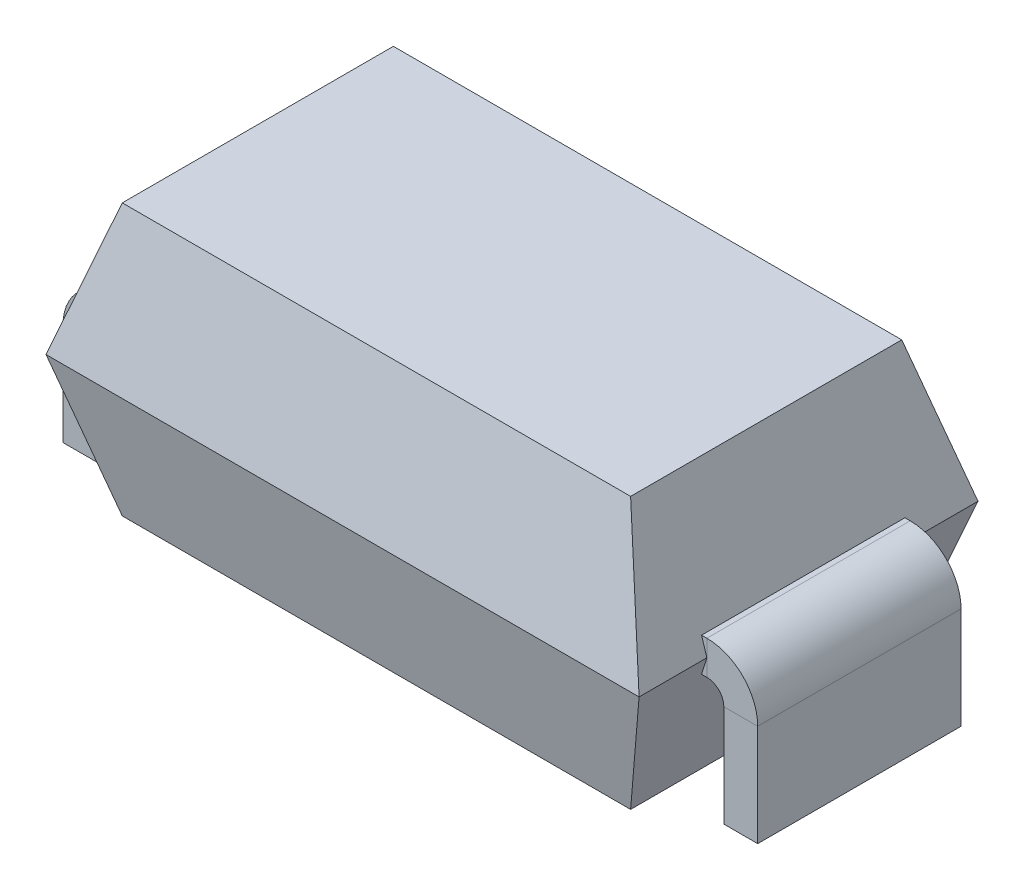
ISO-10303-21;
HEADER;
FILE_DESCRIPTION(('STEP AP214'),'2;1');
FILE_NAME('part.step','',(''),(''),'','','');
FILE_SCHEMA(('AUTOMOTIVE_DESIGN { 1 0 10303 214 1 1 1 1 }'));
ENDSEC;
DATA;
#1=APPLICATION_CONTEXT('core data for automotive mechanical design processes');
#2=APPLICATION_PROTOCOL_DEFINITION('international standard','automotive_design',2000,#1);
#3=PRODUCT_CONTEXT('',#1,'mechanical');
#4=PRODUCT('Part','Part','',(#3));
#5=PRODUCT_RELATED_PRODUCT_CATEGORY('part','',(#4));
#6=PRODUCT_DEFINITION_FORMATION('','',#4);
#7=PRODUCT_DEFINITION_CONTEXT('part definition',#1,'design');
#8=PRODUCT_DEFINITION('design','',#6,#7);
#9=PRODUCT_DEFINITION_SHAPE('','',#8);
#10=(LENGTH_UNIT() NAMED_UNIT(*) SI_UNIT(.MILLI.,.METRE.));
#11=(NAMED_UNIT(*) PLANE_ANGLE_UNIT() SI_UNIT($,.RADIAN.));
#12=(NAMED_UNIT(*) SI_UNIT($,.STERADIAN.) SOLID_ANGLE_UNIT());
#13=UNCERTAINTY_MEASURE_WITH_UNIT(LENGTH_MEASURE(1.E-05),#10,'distance_accuracy_value','');
#14=(GEOMETRIC_REPRESENTATION_CONTEXT(3) GLOBAL_UNCERTAINTY_ASSIGNED_CONTEXT((#13)) GLOBAL_UNIT_ASSIGNED_CONTEXT((#10,
#11,#12)) REPRESENTATION_CONTEXT('',''));
#15=CARTESIAN_POINT('',(0.,0.,0.));
#16=DIRECTION('',(0.,0.,1.));
#17=DIRECTION('',(1.,0.,0.));
#18=AXIS2_PLACEMENT_3D('',#15,#16,#17);
#19=CARTESIAN_POINT('',(0.,0.8,0.));
#20=DIRECTION('',(0.,1.,0.));
#21=DIRECTION('',(0.,0.,1.));
#22=AXIS2_PLACEMENT_3D('',#19,#20,#21);
#23=PLANE('',#22);
#24=DIRECTION('',(0.,0.,-1.));
#25=VECTOR('',#24,1.);
#26=CARTESIAN_POINT('',(1.5,0.8,-0.8));
#27=LINE('',#26,#25);
#28=CARTESIAN_POINT('',(1.5,0.8,0.8));
#29=VERTEX_POINT('',#28);
#30=CARTESIAN_POINT('',(1.5,0.8,-0.8));
#31=VERTEX_POINT('',#30);
#32=EDGE_CURVE('E568',#29,#31,#27,.T.);
#33=ORIENTED_EDGE('',*,*,#32,.T.);
#34=DIRECTION('',(-1.,0.,0.));
#35=VECTOR('',#34,1.);
#36=CARTESIAN_POINT('',(-1.5,0.8,-0.8));
#37=LINE('',#36,#35);
#38=CARTESIAN_POINT('',(-1.5,0.8,-0.8));
#39=VERTEX_POINT('',#38);
#40=EDGE_CURVE('E465',#31,#39,#37,.T.);
#41=ORIENTED_EDGE('',*,*,#40,.T.);
#42=DIRECTION('',(0.,0.,1.));
#43=VECTOR('',#42,1.);
#44=CARTESIAN_POINT('',(-1.5,0.8,-0.8));
#45=LINE('',#44,#43);
#46=CARTESIAN_POINT('',(-1.5,0.8,0.8));
#47=VERTEX_POINT('',#46);
#48=EDGE_CURVE('E688',#39,#47,#45,.T.);
#49=ORIENTED_EDGE('',*,*,#48,.T.);
#50=DIRECTION('',(1.,0.,0.));
#51=VECTOR('',#50,1.);
#52=CARTESIAN_POINT('',(-1.5,0.8,0.8));
#53=LINE('',#52,#51);
#54=EDGE_CURVE('E681',#47,#29,#53,.T.);
#55=ORIENTED_EDGE('',*,*,#54,.T.);
#56=EDGE_LOOP('',(#33,#41,#49,#55));
#57=FACE_BOUND('',#56,.T.);
#58=ADVANCED_FACE('F53',(#57),#23,.T.);
#59=CARTESIAN_POINT('',(-1.59430604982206,0.498220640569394,0.));
#60=DIRECTION('',(0.95447997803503,-0.298274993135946,0.));
#61=DIRECTION('',(0.298274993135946,0.95447997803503,0.));
#62=AXIS2_PLACEMENT_3D('',#59,#60,#61);
#63=PLANE('',#62);
#64=DIRECTION('',(0.,0.,1.));
#65=VECTOR('',#64,1.);
#66=CARTESIAN_POINT('',(-1.75,0.,-1.));
#67=LINE('',#66,#65);
#68=CARTESIAN_POINT('',(-1.75,0.,-1.));
#69=VERTEX_POINT('',#68);
#70=CARTESIAN_POINT('',(-1.75,0.,-0.6));
#71=VERTEX_POINT('',#70);
#72=EDGE_CURVE('E57',#69,#71,#67,.T.);
#73=ORIENTED_EDGE('',*,*,#72,.T.);
#74=DIRECTION('',(0.298274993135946,0.95447997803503,0.));
#75=VECTOR('',#74,1.);
#76=CARTESIAN_POINT('',(-1.59430604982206,0.498220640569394,-0.6));
#77=LINE('',#76,#75);
#78=CARTESIAN_POINT('',(-1.71875,0.1,-0.6));
#79=VERTEX_POINT('',#78);
#80=EDGE_CURVE('E250',#71,#79,#77,.T.);
#81=ORIENTED_EDGE('',*,*,#80,.T.);
#82=DIRECTION('',(0.,0.,1.));
#83=VECTOR('',#82,1.);
#84=CARTESIAN_POINT('',(-1.71875,0.1,0.));
#85=LINE('',#84,#83);
#86=CARTESIAN_POINT('',(-1.71875,0.1,0.6));
#87=VERTEX_POINT('',#86);
#88=EDGE_CURVE('E12',#79,#87,#85,.T.);
#89=ORIENTED_EDGE('',*,*,#88,.T.);
#90=DIRECTION('',(-0.298274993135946,-0.95447997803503,0.));
#91=VECTOR('',#90,1.);
#92=CARTESIAN_POINT('',(-1.59430604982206,0.498220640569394,0.6));
#93=LINE('',#92,#91);
#94=CARTESIAN_POINT('',(-1.75,0.,0.6));
#95=VERTEX_POINT('',#94);
#96=EDGE_CURVE('E260',#87,#95,#93,.T.);
#97=ORIENTED_EDGE('',*,*,#96,.T.);
#98=CARTESIAN_POINT('',(-1.75,0.,1.));
#99=VERTEX_POINT('',#98);
#100=EDGE_CURVE('E496',#95,#99,#67,.T.);
#101=ORIENTED_EDGE('',*,*,#100,.T.);
#102=DIRECTION('',(0.290129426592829,0.928414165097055,-0.232103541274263));
#103=VECTOR('',#102,1.);
#104=CARTESIAN_POINT('',(-1.75,0.,1.));
#105=LINE('',#104,#103);
#106=EDGE_CURVE('E498',#99,#47,#105,.T.);
#107=ORIENTED_EDGE('',*,*,#106,.T.);
#108=ORIENTED_EDGE('',*,*,#48,.F.);
#109=DIRECTION('',(0.29012942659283,0.928414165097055,0.232103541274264));
#110=VECTOR('',#109,1.);
#111=CARTESIAN_POINT('',(-1.75,0.,-1.));
#112=LINE('',#111,#110);
#113=EDGE_CURVE('E572',#69,#39,#112,.T.);
#114=ORIENTED_EDGE('',*,*,#113,.F.);
#115=EDGE_LOOP('',(#73,#81,#89,#97,#101,#107,#108,#114));
#116=FACE_BOUND('',#115,.T.);
#117=ADVANCED_FACE('F314',(#116),#63,.F.);
#118=CARTESIAN_POINT('',(0.,0.235294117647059,-0.941176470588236));
#119=DIRECTION('',(0.,-0.242535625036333,0.970142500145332));
#120=DIRECTION('',(0.,-0.970142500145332,-0.242535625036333));
#121=AXIS2_PLACEMENT_3D('',#118,#119,#120);
#122=PLANE('',#121);
#123=ORIENTED_EDGE('',*,*,#113,.T.);
#124=ORIENTED_EDGE('',*,*,#40,.F.);
#125=DIRECTION('',(-0.290129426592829,0.928414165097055,0.232103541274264));
#126=VECTOR('',#125,1.);
#127=CARTESIAN_POINT('',(1.75,0.,-1.));
#128=LINE('',#127,#126);
#129=CARTESIAN_POINT('',(1.75,0.,-1.));
#130=VERTEX_POINT('',#129);
#131=EDGE_CURVE('E561',#130,#31,#128,.T.);
#132=ORIENTED_EDGE('',*,*,#131,.F.);
#133=DIRECTION('',(-1.,0.,0.));
#134=VECTOR('',#133,1.);
#135=CARTESIAN_POINT('',(-1.75,0.,-1.));
#136=LINE('',#135,#134);
#137=EDGE_CURVE('E354',#130,#69,#136,.T.);
#138=ORIENTED_EDGE('',*,*,#137,.T.);
#139=EDGE_LOOP('',(#123,#124,#132,#138));
#140=FACE_BOUND('',#139,.T.);
#141=ADVANCED_FACE('F545',(#140),#122,.F.);
#142=CARTESIAN_POINT('',(0.,0.235294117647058,0.941176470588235));
#143=DIRECTION('',(0.,-0.242535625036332,-0.970142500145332));
#144=DIRECTION('',(0.,0.970142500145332,-0.242535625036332));
#145=AXIS2_PLACEMENT_3D('',#142,#143,#144);
#146=PLANE('',#145);
#147=DIRECTION('',(-0.29012942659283,0.928414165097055,-0.232103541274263));
#148=VECTOR('',#147,1.);
#149=CARTESIAN_POINT('',(1.75,0.,1.));
#150=LINE('',#149,#148);
#151=CARTESIAN_POINT('',(1.75,0.,1.));
#152=VERTEX_POINT('',#151);
#153=EDGE_CURVE('E569',#152,#29,#150,.T.);
#154=ORIENTED_EDGE('',*,*,#153,.T.);
#155=ORIENTED_EDGE('',*,*,#54,.F.);
#156=ORIENTED_EDGE('',*,*,#106,.F.);
#157=DIRECTION('',(1.,0.,0.));
#158=VECTOR('',#157,1.);
#159=CARTESIAN_POINT('',(-1.75,0.,1.));
#160=LINE('',#159,#158);
#161=EDGE_CURVE('E493',#99,#152,#160,.T.);
#162=ORIENTED_EDGE('',*,*,#161,.T.);
#163=EDGE_LOOP('',(#154,#155,#156,#162));
#164=FACE_BOUND('',#163,.T.);
#165=ADVANCED_FACE('F518',(#164),#146,.F.);
#166=CARTESIAN_POINT('',(1.59430604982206,0.498220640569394,0.));
#167=DIRECTION('',(-0.95447997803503,-0.298274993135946,0.));
#168=DIRECTION('',(0.298274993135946,-0.95447997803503,0.));
#169=AXIS2_PLACEMENT_3D('',#166,#167,#168);
#170=PLANE('',#169);
#171=DIRECTION('',(0.,0.,-1.));
#172=VECTOR('',#171,1.);
#173=CARTESIAN_POINT('',(1.75,0.,-1.));
#174=LINE('',#173,#172);
#175=CARTESIAN_POINT('',(1.75,0.,0.6));
#176=VERTEX_POINT('',#175);
#177=EDGE_CURVE('E481',#152,#176,#174,.T.);
#178=ORIENTED_EDGE('',*,*,#177,.T.);
#179=DIRECTION('',(-0.298274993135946,0.95447997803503,0.));
#180=VECTOR('',#179,1.);
#181=CARTESIAN_POINT('',(1.59430604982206,0.498220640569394,0.6));
#182=LINE('',#181,#180);
#183=CARTESIAN_POINT('',(1.71875,0.1,0.6));
#184=VERTEX_POINT('',#183);
#185=EDGE_CURVE('E340',#176,#184,#182,.T.);
#186=ORIENTED_EDGE('',*,*,#185,.T.);
#187=DIRECTION('',(0.,0.,-1.));
#188=VECTOR('',#187,1.);
#189=CARTESIAN_POINT('',(1.71875,0.1,0.));
#190=LINE('',#189,#188);
#191=CARTESIAN_POINT('',(1.71875,0.1,-0.6));
#192=VERTEX_POINT('',#191);
#193=EDGE_CURVE('E473',#184,#192,#190,.T.);
#194=ORIENTED_EDGE('',*,*,#193,.T.);
#195=DIRECTION('',(0.298274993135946,-0.95447997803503,0.));
#196=VECTOR('',#195,1.);
#197=CARTESIAN_POINT('',(1.59430604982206,0.498220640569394,-0.6));
#198=LINE('',#197,#196);
#199=CARTESIAN_POINT('',(1.75,0.,-0.6));
#200=VERTEX_POINT('',#199);
#201=EDGE_CURVE('E337',#192,#200,#198,.T.);
#202=ORIENTED_EDGE('',*,*,#201,.T.);
#203=EDGE_CURVE('E459',#200,#130,#174,.T.);
#204=ORIENTED_EDGE('',*,*,#203,.T.);
#205=ORIENTED_EDGE('',*,*,#131,.T.);
#206=ORIENTED_EDGE('',*,*,#32,.F.);
#207=ORIENTED_EDGE('',*,*,#153,.F.);
#208=EDGE_LOOP('',(#178,#186,#194,#202,#204,#205,#206,#207));
#209=FACE_BOUND('',#208,.T.);
#210=ADVANCED_FACE('F509',(#209),#170,.F.);
#211=CARTESIAN_POINT('',(0.,-0.8,0.));
#212=DIRECTION('',(0.,-1.,0.));
#213=DIRECTION('',(0.,0.,1.));
#214=AXIS2_PLACEMENT_3D('',#211,#212,#213);
#215=PLANE('',#214);
#216=DIRECTION('',(0.,0.,-1.));
#217=VECTOR('',#216,1.);
#218=CARTESIAN_POINT('',(1.5,-0.8,-0.8));
#219=LINE('',#218,#217);
#220=CARTESIAN_POINT('',(1.5,-0.8,0.8));
#221=VERTEX_POINT('',#220);
#222=CARTESIAN_POINT('',(1.5,-0.8,-0.8));
#223=VERTEX_POINT('',#222);
#224=EDGE_CURVE('E423',#221,#223,#219,.T.);
#225=ORIENTED_EDGE('',*,*,#224,.F.);
#226=DIRECTION('',(1.,0.,0.));
#227=VECTOR('',#226,1.);
#228=CARTESIAN_POINT('',(-1.5,-0.8,0.8));
#229=LINE('',#228,#227);
#230=CARTESIAN_POINT('',(-1.5,-0.8,0.8));
#231=VERTEX_POINT('',#230);
#232=EDGE_CURVE('E409',#231,#221,#229,.T.);
#233=ORIENTED_EDGE('',*,*,#232,.F.);
#234=DIRECTION('',(0.,0.,1.));
#235=VECTOR('',#234,1.);
#236=CARTESIAN_POINT('',(-1.5,-0.8,-0.8));
#237=LINE('',#236,#235);
#238=CARTESIAN_POINT('',(-1.5,-0.8,-0.8));
#239=VERTEX_POINT('',#238);
#240=EDGE_CURVE('E396',#239,#231,#237,.T.);
#241=ORIENTED_EDGE('',*,*,#240,.F.);
#242=DIRECTION('',(-1.,0.,0.));
#243=VECTOR('',#242,1.);
#244=CARTESIAN_POINT('',(-1.5,-0.8,-0.8));
#245=LINE('',#244,#243);
#246=EDGE_CURVE('E482',#223,#239,#245,.T.);
#247=ORIENTED_EDGE('',*,*,#246,.F.);
#248=EDGE_LOOP('',(#225,#233,#241,#247));
#249=FACE_BOUND('',#248,.T.);
#250=ADVANCED_FACE('F439',(#249),#215,.T.);
#251=CARTESIAN_POINT('',(-1.59430604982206,-0.498220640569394,0.));
#252=DIRECTION('',(0.95447997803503,0.298274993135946,0.));
#253=DIRECTION('',(0.298274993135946,-0.95447997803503,0.));
#254=AXIS2_PLACEMENT_3D('',#251,#252,#253);
#255=PLANE('',#254);
#256=DIRECTION('',(0.,0.,-1.));
#257=VECTOR('',#256,1.);
#258=CARTESIAN_POINT('',(-1.71875,-0.1,0.));
#259=LINE('',#258,#257);
#260=CARTESIAN_POINT('',(-1.71875,-0.1,0.6));
#261=VERTEX_POINT('',#260);
#262=CARTESIAN_POINT('',(-1.71875,-0.0999999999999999,-0.6));
#263=VERTEX_POINT('',#262);
#264=EDGE_CURVE('E934',#261,#263,#259,.T.);
#265=ORIENTED_EDGE('',*,*,#264,.T.);
#266=DIRECTION('',(-0.298274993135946,0.95447997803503,0.));
#267=VECTOR('',#266,1.);
#268=CARTESIAN_POINT('',(-1.59430604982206,-0.498220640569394,-0.6));
#269=LINE('',#268,#267);
#270=EDGE_CURVE('E63',#263,#71,#269,.T.);
#271=ORIENTED_EDGE('',*,*,#270,.T.);
#272=ORIENTED_EDGE('',*,*,#72,.F.);
#273=DIRECTION('',(0.29012942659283,-0.928414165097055,0.232103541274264));
#274=VECTOR('',#273,1.);
#275=CARTESIAN_POINT('',(-1.75,0.,-1.));
#276=LINE('',#275,#274);
#277=EDGE_CURVE('E604',#69,#239,#276,.T.);
#278=ORIENTED_EDGE('',*,*,#277,.T.);
#279=ORIENTED_EDGE('',*,*,#240,.T.);
#280=DIRECTION('',(0.290129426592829,-0.928414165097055,-0.232103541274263));
#281=VECTOR('',#280,1.);
#282=CARTESIAN_POINT('',(-1.75,0.,1.));
#283=LINE('',#282,#281);
#284=EDGE_CURVE('E346',#99,#231,#283,.T.);
#285=ORIENTED_EDGE('',*,*,#284,.F.);
#286=ORIENTED_EDGE('',*,*,#100,.F.);
#287=DIRECTION('',(0.298274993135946,-0.95447997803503,0.));
#288=VECTOR('',#287,1.);
#289=CARTESIAN_POINT('',(-1.59430604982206,-0.498220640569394,0.6));
#290=LINE('',#289,#288);
#291=EDGE_CURVE('E478',#95,#261,#290,.T.);
#292=ORIENTED_EDGE('',*,*,#291,.T.);
#293=EDGE_LOOP('',(#265,#271,#272,#278,#279,#285,#286,#292));
#294=FACE_BOUND('',#293,.T.);
#295=ADVANCED_FACE('F373',(#294),#255,.F.);
#296=CARTESIAN_POINT('',(0.,-0.235294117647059,-0.941176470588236));
#297=DIRECTION('',(0.,0.242535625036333,0.970142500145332));
#298=DIRECTION('',(0.,0.970142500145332,-0.242535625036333));
#299=AXIS2_PLACEMENT_3D('',#296,#297,#298);
#300=PLANE('',#299);
#301=ORIENTED_EDGE('',*,*,#277,.F.);
#302=ORIENTED_EDGE('',*,*,#137,.F.);
#303=DIRECTION('',(-0.290129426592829,-0.928414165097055,0.232103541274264));
#304=VECTOR('',#303,1.);
#305=CARTESIAN_POINT('',(1.75,0.,-1.));
#306=LINE('',#305,#304);
#307=EDGE_CURVE('E360',#130,#223,#306,.T.);
#308=ORIENTED_EDGE('',*,*,#307,.T.);
#309=ORIENTED_EDGE('',*,*,#246,.T.);
#310=EDGE_LOOP('',(#301,#302,#308,#309));
#311=FACE_BOUND('',#310,.T.);
#312=ADVANCED_FACE('F362',(#311),#300,.F.);
#313=CARTESIAN_POINT('',(0.,-0.235294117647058,0.941176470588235));
#314=DIRECTION('',(0.,0.242535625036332,-0.970142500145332));
#315=DIRECTION('',(0.,-0.970142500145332,-0.242535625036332));
#316=AXIS2_PLACEMENT_3D('',#313,#314,#315);
#317=PLANE('',#316);
#318=DIRECTION('',(-0.29012942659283,-0.928414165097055,-0.232103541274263));
#319=VECTOR('',#318,1.);
#320=CARTESIAN_POINT('',(1.75,0.,1.));
#321=LINE('',#320,#319);
#322=EDGE_CURVE('E613',#152,#221,#321,.T.);
#323=ORIENTED_EDGE('',*,*,#322,.F.);
#324=ORIENTED_EDGE('',*,*,#161,.F.);
#325=ORIENTED_EDGE('',*,*,#284,.T.);
#326=ORIENTED_EDGE('',*,*,#232,.T.);
#327=EDGE_LOOP('',(#323,#324,#325,#326));
#328=FACE_BOUND('',#327,.T.);
#329=ADVANCED_FACE('F372',(#328),#317,.F.);
#330=CARTESIAN_POINT('',(1.59430604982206,-0.498220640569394,0.));
#331=DIRECTION('',(-0.95447997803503,0.298274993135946,0.));
#332=DIRECTION('',(0.298274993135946,0.95447997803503,0.));
#333=AXIS2_PLACEMENT_3D('',#330,#331,#332);
#334=PLANE('',#333);
#335=DIRECTION('',(0.,0.,1.));
#336=VECTOR('',#335,1.);
#337=CARTESIAN_POINT('',(1.71875,-0.1,0.));
#338=LINE('',#337,#336);
#339=CARTESIAN_POINT('',(1.71875,-0.0999999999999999,-0.6));
#340=VERTEX_POINT('',#339);
#341=CARTESIAN_POINT('',(1.71875,-0.1,0.6));
#342=VERTEX_POINT('',#341);
#343=EDGE_CURVE('E464',#340,#342,#338,.T.);
#344=ORIENTED_EDGE('',*,*,#343,.T.);
#345=DIRECTION('',(0.298274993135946,0.95447997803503,0.));
#346=VECTOR('',#345,1.);
#347=CARTESIAN_POINT('',(1.59430604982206,-0.498220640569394,0.6));
#348=LINE('',#347,#346);
#349=EDGE_CURVE('E470',#342,#176,#348,.T.);
#350=ORIENTED_EDGE('',*,*,#349,.T.);
#351=ORIENTED_EDGE('',*,*,#177,.F.);
#352=ORIENTED_EDGE('',*,*,#322,.T.);
#353=ORIENTED_EDGE('',*,*,#224,.T.);
#354=ORIENTED_EDGE('',*,*,#307,.F.);
#355=ORIENTED_EDGE('',*,*,#203,.F.);
#356=DIRECTION('',(-0.298274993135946,-0.95447997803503,0.));
#357=VECTOR('',#356,1.);
#358=CARTESIAN_POINT('',(1.59430604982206,-0.498220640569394,-0.6));
#359=LINE('',#358,#357);
#360=EDGE_CURVE('E462',#200,#340,#359,.T.);
#361=ORIENTED_EDGE('',*,*,#360,.T.);
#362=EDGE_LOOP('',(#344,#350,#351,#352,#353,#354,#355,#361));
#363=FACE_BOUND('',#362,.T.);
#364=ADVANCED_FACE('F429',(#363),#334,.F.);
#365=CARTESIAN_POINT('',(1.55,0.1,-0.6));
#366=DIRECTION('',(0.,1.,0.));
#367=DIRECTION('',(0.,0.,1.));
#368=AXIS2_PLACEMENT_3D('',#365,#366,#367);
#369=PLANE('',#368);
#370=ORIENTED_EDGE('',*,*,#193,.F.);
#371=DIRECTION('',(1.,0.,0.));
#372=VECTOR('',#371,1.);
#373=CARTESIAN_POINT('',(1.55,0.1,0.6));
#374=LINE('',#373,#372);
#375=CARTESIAN_POINT('',(1.75,0.1,0.6));
#376=VERTEX_POINT('',#375);
#377=EDGE_CURVE('E318',#184,#376,#374,.T.);
#378=ORIENTED_EDGE('',*,*,#377,.T.);
#379=DIRECTION('',(0.,0.,1.));
#380=VECTOR('',#379,1.);
#381=CARTESIAN_POINT('',(1.75,0.1,-0.6));
#382=LINE('',#381,#380);
#383=CARTESIAN_POINT('',(1.75,0.1,-0.6));
#384=VERTEX_POINT('',#383);
#385=EDGE_CURVE('E777',#384,#376,#382,.T.);
#386=ORIENTED_EDGE('',*,*,#385,.F.);
#387=DIRECTION('',(1.,0.,0.));
#388=VECTOR('',#387,1.);
#389=CARTESIAN_POINT('',(1.55,0.1,-0.6));
#390=LINE('',#389,#388);
#391=EDGE_CURVE('E767',#192,#384,#390,.T.);
#392=ORIENTED_EDGE('',*,*,#391,.F.);
#393=EDGE_LOOP('',(#370,#378,#386,#392));
#394=FACE_BOUND('',#393,.T.);
#395=ADVANCED_FACE('F438',(#394),#369,.T.);
#396=CARTESIAN_POINT('',(1.55,0.1,0.6));
#397=DIRECTION('',(0.,0.,1.));
#398=DIRECTION('',(1.,0.,0.));
#399=AXIS2_PLACEMENT_3D('',#396,#397,#398);
#400=PLANE('',#399);
#401=ORIENTED_EDGE('',*,*,#185,.F.);
#402=DIRECTION('',(0.,-1.,0.));
#403=VECTOR('',#402,1.);
#404=CARTESIAN_POINT('',(1.75,0.1,0.6));
#405=LINE('',#404,#403);
#406=EDGE_CURVE('E334',#376,#176,#405,.T.);
#407=ORIENTED_EDGE('',*,*,#406,.F.);
#408=ORIENTED_EDGE('',*,*,#377,.F.);
#409=EDGE_LOOP('',(#401,#407,#408));
#410=FACE_BOUND('',#409,.T.);
#411=ADVANCED_FACE('F834',(#410),#400,.T.);
#412=ORIENTED_EDGE('',*,*,#349,.F.);
#413=DIRECTION('',(1.,0.,0.));
#414=VECTOR('',#413,1.);
#415=CARTESIAN_POINT('',(1.55,-0.1,0.6));
#416=LINE('',#415,#414);
#417=CARTESIAN_POINT('',(1.75,-0.1,0.6));
#418=VERTEX_POINT('',#417);
#419=EDGE_CURVE('E329',#342,#418,#416,.T.);
#420=ORIENTED_EDGE('',*,*,#419,.T.);
#421=EDGE_CURVE('E320',#176,#418,#405,.T.);
#422=ORIENTED_EDGE('',*,*,#421,.F.);
#423=EDGE_LOOP('',(#412,#420,#422));
#424=FACE_BOUND('',#423,.T.);
#425=ADVANCED_FACE('F734',(#424),#400,.T.);
#426=CARTESIAN_POINT('',(1.55,-0.0999999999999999,-0.6));
#427=DIRECTION('',(0.,-1.,0.));
#428=DIRECTION('',(0.,0.,-1.));
#429=AXIS2_PLACEMENT_3D('',#426,#427,#428);
#430=PLANE('',#429);
#431=ORIENTED_EDGE('',*,*,#343,.F.);
#432=DIRECTION('',(1.,0.,0.));
#433=VECTOR('',#432,1.);
#434=CARTESIAN_POINT('',(1.55,-0.0999999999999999,-0.6));
#435=LINE('',#434,#433);
#436=CARTESIAN_POINT('',(1.75,-0.0999999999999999,-0.6));
#437=VERTEX_POINT('',#436);
#438=EDGE_CURVE('E79',#340,#437,#435,.T.);
#439=ORIENTED_EDGE('',*,*,#438,.T.);
#440=DIRECTION('',(0.,0.,-1.));
#441=VECTOR('',#440,1.);
#442=CARTESIAN_POINT('',(1.75,-0.0999999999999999,-0.6));
#443=LINE('',#442,#441);
#444=EDGE_CURVE('E740',#418,#437,#443,.T.);
#445=ORIENTED_EDGE('',*,*,#444,.F.);
#446=ORIENTED_EDGE('',*,*,#419,.F.);
#447=EDGE_LOOP('',(#431,#439,#445,#446));
#448=FACE_BOUND('',#447,.T.);
#449=ADVANCED_FACE('F738',(#448),#430,.T.);
#450=CARTESIAN_POINT('',(1.55,0.1,-0.6));
#451=DIRECTION('',(0.,0.,-1.));
#452=DIRECTION('',(-1.,0.,0.));
#453=AXIS2_PLACEMENT_3D('',#450,#451,#452);
#454=PLANE('',#453);
#455=ORIENTED_EDGE('',*,*,#201,.F.);
#456=ORIENTED_EDGE('',*,*,#391,.T.);
#457=DIRECTION('',(0.,1.,0.));
#458=VECTOR('',#457,1.);
#459=CARTESIAN_POINT('',(1.75,0.1,-0.6));
#460=LINE('',#459,#458);
#461=EDGE_CURVE('E745',#200,#384,#460,.T.);
#462=ORIENTED_EDGE('',*,*,#461,.F.);
#463=EDGE_LOOP('',(#455,#456,#462));
#464=FACE_BOUND('',#463,.T.);
#465=ADVANCED_FACE('F853',(#464),#454,.T.);
#466=ORIENTED_EDGE('',*,*,#360,.F.);
#467=EDGE_CURVE('E772',#437,#200,#460,.T.);
#468=ORIENTED_EDGE('',*,*,#467,.F.);
#469=ORIENTED_EDGE('',*,*,#438,.F.);
#470=EDGE_LOOP('',(#466,#468,#469));
#471=FACE_BOUND('',#470,.T.);
#472=ADVANCED_FACE('F860',(#471),#454,.T.);
#473=CARTESIAN_POINT('',(1.95,-0.8,0.));
#474=DIRECTION('',(0.,1.,0.));
#475=DIRECTION('',(0.,0.,1.));
#476=AXIS2_PLACEMENT_3D('',#473,#474,#475);
#477=PLANE('',#476);
#478=DIRECTION('',(-1.,0.,0.));
#479=VECTOR('',#478,1.);
#480=CARTESIAN_POINT('',(2.05,-0.8,0.6));
#481=LINE('',#480,#479);
#482=CARTESIAN_POINT('',(2.05,-0.8,0.6));
#483=VERTEX_POINT('',#482);
#484=CARTESIAN_POINT('',(1.85,-0.8,0.6));
#485=VERTEX_POINT('',#484);
#486=EDGE_CURVE('E824',#483,#485,#481,.T.);
#487=ORIENTED_EDGE('',*,*,#486,.T.);
#488=DIRECTION('',(0.,0.,-1.));
#489=VECTOR('',#488,1.);
#490=CARTESIAN_POINT('',(1.85,-0.8,-0.6));
#491=LINE('',#490,#489);
#492=CARTESIAN_POINT('',(1.85,-0.8,-0.6));
#493=VERTEX_POINT('',#492);
#494=EDGE_CURVE('E758',#485,#493,#491,.T.);
#495=ORIENTED_EDGE('',*,*,#494,.T.);
#496=DIRECTION('',(1.,0.,0.));
#497=VECTOR('',#496,1.);
#498=CARTESIAN_POINT('',(2.05,-0.8,-0.6));
#499=LINE('',#498,#497);
#500=CARTESIAN_POINT('',(2.05,-0.8,-0.6));
#501=VERTEX_POINT('',#500);
#502=EDGE_CURVE('E764',#493,#501,#499,.T.);
#503=ORIENTED_EDGE('',*,*,#502,.T.);
#504=DIRECTION('',(0.,0.,1.));
#505=VECTOR('',#504,1.);
#506=CARTESIAN_POINT('',(2.05,-0.8,-0.6));
#507=LINE('',#506,#505);
#508=EDGE_CURVE('E341',#501,#483,#507,.T.);
#509=ORIENTED_EDGE('',*,*,#508,.T.);
#510=EDGE_LOOP('',(#487,#495,#503,#509));
#511=FACE_BOUND('',#510,.T.);
#512=ADVANCED_FACE('F848',(#511),#477,.F.);
#513=CARTESIAN_POINT('',(1.75,0.1,0.6));
#514=DIRECTION('',(0.,0.,1.));
#515=DIRECTION('',(1.,0.,0.));
#516=AXIS2_PLACEMENT_3D('',#513,#514,#515);
#517=PLANE('',#516);
#518=CARTESIAN_POINT('',(1.75,-0.2,0.6));
#519=DIRECTION('',(0.,0.,-1.));
#520=DIRECTION('',(0.,1.,0.));
#521=AXIS2_PLACEMENT_3D('',#518,#519,#520);
#522=CIRCLE('',#521,0.1);
#523=CARTESIAN_POINT('',(1.85,-0.2,0.6));
#524=VERTEX_POINT('',#523);
#525=EDGE_CURVE('E755',#418,#524,#522,.T.);
#526=ORIENTED_EDGE('',*,*,#525,.T.);
#527=DIRECTION('',(-1.,0.,0.));
#528=VECTOR('',#527,1.);
#529=CARTESIAN_POINT('',(2.05,-0.2,0.6));
#530=LINE('',#529,#528);
#531=CARTESIAN_POINT('',(2.05,-0.2,0.6));
#532=VERTEX_POINT('',#531);
#533=EDGE_CURVE('E802',#532,#524,#530,.T.);
#534=ORIENTED_EDGE('',*,*,#533,.F.);
#535=CARTESIAN_POINT('',(1.75,-0.2,0.6));
#536=DIRECTION('',(0.,0.,-1.));
#537=DIRECTION('',(0.,1.,0.));
#538=AXIS2_PLACEMENT_3D('',#535,#536,#537);
#539=CIRCLE('',#538,0.3);
#540=EDGE_CURVE('E800',#376,#532,#539,.T.);
#541=ORIENTED_EDGE('',*,*,#540,.F.);
#542=ORIENTED_EDGE('',*,*,#406,.T.);
#543=ORIENTED_EDGE('',*,*,#421,.T.);
#544=EDGE_LOOP('',(#526,#534,#541,#542,#543));
#545=FACE_BOUND('',#544,.T.);
#546=ADVANCED_FACE('F832',(#545),#517,.T.);
#547=CARTESIAN_POINT('',(1.75,-0.2,0.));
#548=DIRECTION('',(0.,0.,-1.));
#549=DIRECTION('',(-1.,0.,0.));
#550=AXIS2_PLACEMENT_3D('',#547,#548,#549);
#551=CYLINDRICAL_SURFACE('',#550,0.1);
#552=CARTESIAN_POINT('',(1.75,-0.2,-0.6));
#553=DIRECTION('',(0.,0.,-1.));
#554=DIRECTION('',(0.,1.,0.));
#555=AXIS2_PLACEMENT_3D('',#552,#553,#554);
#556=CIRCLE('',#555,0.1);
#557=CARTESIAN_POINT('',(1.85,-0.2,-0.6));
#558=VERTEX_POINT('',#557);
#559=EDGE_CURVE('E754',#437,#558,#556,.T.);
#560=ORIENTED_EDGE('',*,*,#559,.T.);
#561=DIRECTION('',(0.,0.,-1.));
#562=VECTOR('',#561,1.);
#563=CARTESIAN_POINT('',(1.85,-0.2,-0.6));
#564=LINE('',#563,#562);
#565=EDGE_CURVE('E751',#524,#558,#564,.T.);
#566=ORIENTED_EDGE('',*,*,#565,.F.);
#567=ORIENTED_EDGE('',*,*,#525,.F.);
#568=ORIENTED_EDGE('',*,*,#444,.T.);
#569=EDGE_LOOP('',(#560,#566,#567,#568));
#570=FACE_BOUND('',#569,.T.);
#571=ADVANCED_FACE('F816',(#570),#551,.F.);
#572=CARTESIAN_POINT('',(1.75,0.1,-0.6));
#573=DIRECTION('',(0.,0.,-1.));
#574=DIRECTION('',(-1.,0.,0.));
#575=AXIS2_PLACEMENT_3D('',#572,#573,#574);
#576=PLANE('',#575);
#577=CARTESIAN_POINT('',(1.75,-0.2,-0.6));
#578=DIRECTION('',(0.,0.,-1.));
#579=DIRECTION('',(0.,1.,0.));
#580=AXIS2_PLACEMENT_3D('',#577,#578,#579);
#581=CIRCLE('',#580,0.3);
#582=CARTESIAN_POINT('',(2.05,-0.2,-0.6));
#583=VERTEX_POINT('',#582);
#584=EDGE_CURVE('E783',#384,#583,#581,.T.);
#585=ORIENTED_EDGE('',*,*,#584,.T.);
#586=DIRECTION('',(1.,0.,0.));
#587=VECTOR('',#586,1.);
#588=CARTESIAN_POINT('',(2.05,-0.2,-0.6));
#589=LINE('',#588,#587);
#590=EDGE_CURVE('E757',#558,#583,#589,.T.);
#591=ORIENTED_EDGE('',*,*,#590,.F.);
#592=ORIENTED_EDGE('',*,*,#559,.F.);
#593=ORIENTED_EDGE('',*,*,#467,.T.);
#594=ORIENTED_EDGE('',*,*,#461,.T.);
#595=EDGE_LOOP('',(#585,#591,#592,#593,#594));
#596=FACE_BOUND('',#595,.T.);
#597=ADVANCED_FACE('F781',(#596),#576,.T.);
#598=CARTESIAN_POINT('',(1.75,-0.2,0.));
#599=DIRECTION('',(0.,0.,-1.));
#600=DIRECTION('',(-1.,0.,0.));
#601=AXIS2_PLACEMENT_3D('',#598,#599,#600);
#602=CYLINDRICAL_SURFACE('',#601,0.3);
#603=DIRECTION('',(0.,0.,1.));
#604=VECTOR('',#603,1.);
#605=CARTESIAN_POINT('',(2.05,-0.2,-0.6));
#606=LINE('',#605,#604);
#607=EDGE_CURVE('E794',#583,#532,#606,.T.);
#608=ORIENTED_EDGE('',*,*,#607,.F.);
#609=ORIENTED_EDGE('',*,*,#584,.F.);
#610=ORIENTED_EDGE('',*,*,#385,.T.);
#611=ORIENTED_EDGE('',*,*,#540,.T.);
#612=EDGE_LOOP('',(#608,#609,#610,#611));
#613=FACE_BOUND('',#612,.T.);
#614=ADVANCED_FACE('F790',(#613),#602,.T.);
#615=CARTESIAN_POINT('',(2.05,-0.2,0.6));
#616=DIRECTION('',(0.,0.,1.));
#617=DIRECTION('',(1.,0.,0.));
#618=AXIS2_PLACEMENT_3D('',#615,#616,#617);
#619=PLANE('',#618);
#620=DIRECTION('',(0.,-1.,0.));
#621=VECTOR('',#620,1.);
#622=CARTESIAN_POINT('',(1.85,-0.2,0.6));
#623=LINE('',#622,#621);
#624=EDGE_CURVE('E761',#524,#485,#623,.T.);
#625=ORIENTED_EDGE('',*,*,#624,.T.);
#626=ORIENTED_EDGE('',*,*,#486,.F.);
#627=DIRECTION('',(0.,-1.,0.));
#628=VECTOR('',#627,1.);
#629=CARTESIAN_POINT('',(2.05,-0.2,0.6));
#630=LINE('',#629,#628);
#631=EDGE_CURVE('E748',#532,#483,#630,.T.);
#632=ORIENTED_EDGE('',*,*,#631,.F.);
#633=ORIENTED_EDGE('',*,*,#533,.T.);
#634=EDGE_LOOP('',(#625,#626,#632,#633));
#635=FACE_BOUND('',#634,.T.);
#636=ADVANCED_FACE('F829',(#635),#619,.T.);
#637=CARTESIAN_POINT('',(1.85,-0.2,-0.6));
#638=DIRECTION('',(-1.,0.,0.));
#639=DIRECTION('',(0.,-1.,0.));
#640=AXIS2_PLACEMENT_3D('',#637,#638,#639);
#641=PLANE('',#640);
#642=DIRECTION('',(0.,-1.,0.));
#643=VECTOR('',#642,1.);
#644=CARTESIAN_POINT('',(1.85,-0.2,-0.6));
#645=LINE('',#644,#643);
#646=EDGE_CURVE('E760',#558,#493,#645,.T.);
#647=ORIENTED_EDGE('',*,*,#646,.T.);
#648=ORIENTED_EDGE('',*,*,#494,.F.);
#649=ORIENTED_EDGE('',*,*,#624,.F.);
#650=ORIENTED_EDGE('',*,*,#565,.T.);
#651=EDGE_LOOP('',(#647,#648,#649,#650));
#652=FACE_BOUND('',#651,.T.);
#653=ADVANCED_FACE('F819',(#652),#641,.T.);
#654=CARTESIAN_POINT('',(2.05,-0.2,-0.6));
#655=DIRECTION('',(0.,0.,-1.));
#656=DIRECTION('',(-1.,0.,0.));
#657=AXIS2_PLACEMENT_3D('',#654,#655,#656);
#658=PLANE('',#657);
#659=DIRECTION('',(0.,-1.,0.));
#660=VECTOR('',#659,1.);
#661=CARTESIAN_POINT('',(2.05,-0.2,-0.6));
#662=LINE('',#661,#660);
#663=EDGE_CURVE('E806',#583,#501,#662,.T.);
#664=ORIENTED_EDGE('',*,*,#663,.T.);
#665=ORIENTED_EDGE('',*,*,#502,.F.);
#666=ORIENTED_EDGE('',*,*,#646,.F.);
#667=ORIENTED_EDGE('',*,*,#590,.T.);
#668=EDGE_LOOP('',(#664,#665,#666,#667));
#669=FACE_BOUND('',#668,.T.);
#670=ADVANCED_FACE('F814',(#669),#658,.T.);
#671=CARTESIAN_POINT('',(2.05,-0.2,-0.6));
#672=DIRECTION('',(1.,0.,0.));
#673=DIRECTION('',(0.,1.,0.));
#674=AXIS2_PLACEMENT_3D('',#671,#672,#673);
#675=PLANE('',#674);
#676=ORIENTED_EDGE('',*,*,#508,.F.);
#677=ORIENTED_EDGE('',*,*,#663,.F.);
#678=ORIENTED_EDGE('',*,*,#607,.T.);
#679=ORIENTED_EDGE('',*,*,#631,.T.);
#680=EDGE_LOOP('',(#676,#677,#678,#679));
#681=FACE_BOUND('',#680,.T.);
#682=ADVANCED_FACE('F864',(#681),#675,.T.);
#683=CARTESIAN_POINT('',(-1.55,0.1,-0.6));
#684=DIRECTION('',(0.,1.,0.));
#685=DIRECTION('',(0.,0.,1.));
#686=AXIS2_PLACEMENT_3D('',#683,#684,#685);
#687=PLANE('',#686);
#688=ORIENTED_EDGE('',*,*,#88,.F.);
#689=DIRECTION('',(-1.,0.,0.));
#690=VECTOR('',#689,1.);
#691=CARTESIAN_POINT('',(-1.55,0.1,-0.6));
#692=LINE('',#691,#690);
#693=CARTESIAN_POINT('',(-1.75,0.1,-0.6));
#694=VERTEX_POINT('',#693);
#695=EDGE_CURVE('E217',#79,#694,#692,.T.);
#696=ORIENTED_EDGE('',*,*,#695,.T.);
#697=DIRECTION('',(0.,0.,1.));
#698=VECTOR('',#697,1.);
#699=CARTESIAN_POINT('',(-1.75,0.1,-0.6));
#700=LINE('',#699,#698);
#701=CARTESIAN_POINT('',(-1.75,0.1,0.6));
#702=VERTEX_POINT('',#701);
#703=EDGE_CURVE('E222',#702,#694,#700,.F.);
#704=ORIENTED_EDGE('',*,*,#703,.F.);
#705=DIRECTION('',(-1.,0.,0.));
#706=VECTOR('',#705,1.);
#707=CARTESIAN_POINT('',(-1.55,0.1,0.6));
#708=LINE('',#707,#706);
#709=EDGE_CURVE('E247',#87,#702,#708,.T.);
#710=ORIENTED_EDGE('',*,*,#709,.F.);
#711=EDGE_LOOP('',(#688,#696,#704,#710));
#712=FACE_BOUND('',#711,.T.);
#713=ADVANCED_FACE('F219',(#712),#687,.T.);
#714=CARTESIAN_POINT('',(-1.55,0.1,-0.6));
#715=DIRECTION('',(0.,0.,-1.));
#716=DIRECTION('',(-1.,0.,0.));
#717=AXIS2_PLACEMENT_3D('',#714,#715,#716);
#718=PLANE('',#717);
#719=ORIENTED_EDGE('',*,*,#80,.F.);
#720=DIRECTION('',(0.,1.,0.));
#721=VECTOR('',#720,1.);
#722=CARTESIAN_POINT('',(-1.75,0.1,-0.6));
#723=LINE('',#722,#721);
#724=EDGE_CURVE('E236',#694,#71,#723,.F.);
#725=ORIENTED_EDGE('',*,*,#724,.F.);
#726=ORIENTED_EDGE('',*,*,#695,.F.);
#727=EDGE_LOOP('',(#719,#725,#726));
#728=FACE_BOUND('',#727,.T.);
#729=ADVANCED_FACE('F249',(#728),#718,.T.);
#730=ORIENTED_EDGE('',*,*,#270,.F.);
#731=DIRECTION('',(-1.,0.,0.));
#732=VECTOR('',#731,1.);
#733=CARTESIAN_POINT('',(-1.55,-0.0999999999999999,-0.6));
#734=LINE('',#733,#732);
#735=CARTESIAN_POINT('',(-1.75,-0.0999999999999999,-0.6));
#736=VERTEX_POINT('',#735);
#737=EDGE_CURVE('E252',#263,#736,#734,.T.);
#738=ORIENTED_EDGE('',*,*,#737,.T.);
#739=EDGE_CURVE('E226',#71,#736,#723,.F.);
#740=ORIENTED_EDGE('',*,*,#739,.F.);
#741=EDGE_LOOP('',(#730,#738,#740));
#742=FACE_BOUND('',#741,.T.);
#743=ADVANCED_FACE('F879',(#742),#718,.T.);
#744=CARTESIAN_POINT('',(-1.55,-0.0999999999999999,-0.6));
#745=DIRECTION('',(0.,-1.,0.));
#746=DIRECTION('',(0.,0.,-1.));
#747=AXIS2_PLACEMENT_3D('',#744,#745,#746);
#748=PLANE('',#747);
#749=ORIENTED_EDGE('',*,*,#264,.F.);
#750=DIRECTION('',(-1.,0.,0.));
#751=VECTOR('',#750,1.);
#752=CARTESIAN_POINT('',(-1.55,-0.1,0.6));
#753=LINE('',#752,#751);
#754=CARTESIAN_POINT('',(-1.75,-0.1,0.6));
#755=VERTEX_POINT('',#754);
#756=EDGE_CURVE('E71',#261,#755,#753,.T.);
#757=ORIENTED_EDGE('',*,*,#756,.T.);
#758=DIRECTION('',(0.,0.,-1.));
#759=VECTOR('',#758,1.);
#760=CARTESIAN_POINT('',(-1.75,-0.0999999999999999,-0.6));
#761=LINE('',#760,#759);
#762=EDGE_CURVE('E254',#736,#755,#761,.F.);
#763=ORIENTED_EDGE('',*,*,#762,.F.);
#764=ORIENTED_EDGE('',*,*,#737,.F.);
#765=EDGE_LOOP('',(#749,#757,#763,#764));
#766=FACE_BOUND('',#765,.T.);
#767=ADVANCED_FACE('F904',(#766),#748,.T.);
#768=CARTESIAN_POINT('',(-1.55,0.1,0.6));
#769=DIRECTION('',(0.,0.,1.));
#770=DIRECTION('',(1.,0.,0.));
#771=AXIS2_PLACEMENT_3D('',#768,#769,#770);
#772=PLANE('',#771);
#773=ORIENTED_EDGE('',*,*,#96,.F.);
#774=ORIENTED_EDGE('',*,*,#709,.T.);
#775=DIRECTION('',(0.,-1.,0.));
#776=VECTOR('',#775,1.);
#777=CARTESIAN_POINT('',(-1.75,0.1,0.6));
#778=LINE('',#777,#776);
#779=EDGE_CURVE('E282',#95,#702,#778,.F.);
#780=ORIENTED_EDGE('',*,*,#779,.F.);
#781=EDGE_LOOP('',(#773,#774,#780));
#782=FACE_BOUND('',#781,.T.);
#783=ADVANCED_FACE('F311',(#782),#772,.T.);
#784=ORIENTED_EDGE('',*,*,#291,.F.);
#785=EDGE_CURVE('E300',#755,#95,#778,.F.);
#786=ORIENTED_EDGE('',*,*,#785,.F.);
#787=ORIENTED_EDGE('',*,*,#756,.F.);
#788=EDGE_LOOP('',(#784,#786,#787));
#789=FACE_BOUND('',#788,.T.);
#790=ADVANCED_FACE('F890',(#789),#772,.T.);
#791=CARTESIAN_POINT('',(-1.95,-0.8,0.));
#792=DIRECTION('',(0.,1.,0.));
#793=DIRECTION('',(0.,0.,1.));
#794=AXIS2_PLACEMENT_3D('',#791,#792,#793);
#795=PLANE('',#794);
#796=DIRECTION('',(1.,0.,0.));
#797=VECTOR('',#796,1.);
#798=CARTESIAN_POINT('',(-2.05,-0.8,0.6));
#799=LINE('',#798,#797);
#800=CARTESIAN_POINT('',(-1.85,-0.8,0.6));
#801=VERTEX_POINT('',#800);
#802=CARTESIAN_POINT('',(-2.05,-0.8,0.6));
#803=VERTEX_POINT('',#802);
#804=EDGE_CURVE('E293',#801,#803,#799,.F.);
#805=ORIENTED_EDGE('',*,*,#804,.T.);
#806=DIRECTION('',(0.,0.,1.));
#807=VECTOR('',#806,1.);
#808=CARTESIAN_POINT('',(-2.05,-0.8,-0.6));
#809=LINE('',#808,#807);
#810=CARTESIAN_POINT('',(-2.05,-0.8,-0.6));
#811=VERTEX_POINT('',#810);
#812=EDGE_CURVE('E322',#803,#811,#809,.F.);
#813=ORIENTED_EDGE('',*,*,#812,.T.);
#814=DIRECTION('',(-1.,0.,0.));
#815=VECTOR('',#814,1.);
#816=CARTESIAN_POINT('',(-2.05,-0.8,-0.6));
#817=LINE('',#816,#815);
#818=CARTESIAN_POINT('',(-1.85,-0.8,-0.6));
#819=VERTEX_POINT('',#818);
#820=EDGE_CURVE('E269',#811,#819,#817,.F.);
#821=ORIENTED_EDGE('',*,*,#820,.T.);
#822=DIRECTION('',(0.,0.,-1.));
#823=VECTOR('',#822,1.);
#824=CARTESIAN_POINT('',(-1.85,-0.8,-0.6));
#825=LINE('',#824,#823);
#826=EDGE_CURVE('E275',#819,#801,#825,.F.);
#827=ORIENTED_EDGE('',*,*,#826,.T.);
#828=EDGE_LOOP('',(#805,#813,#821,#827));
#829=FACE_BOUND('',#828,.T.);
#830=ADVANCED_FACE('F844',(#829),#795,.F.);
#831=CARTESIAN_POINT('',(-1.75,0.1,-0.6));
#832=DIRECTION('',(0.,0.,-1.));
#833=DIRECTION('',(-1.,0.,0.));
#834=AXIS2_PLACEMENT_3D('',#831,#832,#833);
#835=PLANE('',#834);
#836=CARTESIAN_POINT('',(-1.75,-0.2,-0.6));
#837=DIRECTION('',(0.,0.,1.));
#838=DIRECTION('',(0.,1.,0.));
#839=AXIS2_PLACEMENT_3D('',#836,#837,#838);
#840=CIRCLE('',#839,0.1);
#841=CARTESIAN_POINT('',(-1.85,-0.2,-0.6));
#842=VERTEX_POINT('',#841);
#843=EDGE_CURVE('E266',#736,#842,#840,.T.);
#844=ORIENTED_EDGE('',*,*,#843,.T.);
#845=DIRECTION('',(-1.,0.,0.));
#846=VECTOR('',#845,1.);
#847=CARTESIAN_POINT('',(-2.05,-0.2,-0.6));
#848=LINE('',#847,#846);
#849=CARTESIAN_POINT('',(-2.05,-0.2,-0.6));
#850=VERTEX_POINT('',#849);
#851=EDGE_CURVE('E239',#850,#842,#848,.F.);
#852=ORIENTED_EDGE('',*,*,#851,.F.);
#853=CARTESIAN_POINT('',(-1.75,-0.2,-0.6));
#854=DIRECTION('',(0.,0.,1.));
#855=DIRECTION('',(0.,1.,0.));
#856=AXIS2_PLACEMENT_3D('',#853,#854,#855);
#857=CIRCLE('',#856,0.3);
#858=EDGE_CURVE('E232',#694,#850,#857,.T.);
#859=ORIENTED_EDGE('',*,*,#858,.F.);
#860=ORIENTED_EDGE('',*,*,#724,.T.);
#861=ORIENTED_EDGE('',*,*,#739,.T.);
#862=EDGE_LOOP('',(#844,#852,#859,#860,#861));
#863=FACE_BOUND('',#862,.T.);
#864=ADVANCED_FACE('F234',(#863),#835,.T.);
#865=CARTESIAN_POINT('',(-1.75,-0.2,0.));
#866=DIRECTION('',(0.,0.,1.));
#867=DIRECTION('',(1.,0.,0.));
#868=AXIS2_PLACEMENT_3D('',#865,#866,#867);
#869=CYLINDRICAL_SURFACE('',#868,0.1);
#870=CARTESIAN_POINT('',(-1.75,-0.2,0.6));
#871=DIRECTION('',(0.,0.,1.));
#872=DIRECTION('',(0.,1.,0.));
#873=AXIS2_PLACEMENT_3D('',#870,#871,#872);
#874=CIRCLE('',#873,0.1);
#875=CARTESIAN_POINT('',(-1.85,-0.2,0.6));
#876=VERTEX_POINT('',#875);
#877=EDGE_CURVE('E285',#755,#876,#874,.T.);
#878=ORIENTED_EDGE('',*,*,#877,.T.);
#879=DIRECTION('',(0.,0.,-1.));
#880=VECTOR('',#879,1.);
#881=CARTESIAN_POINT('',(-1.85,-0.2,-0.6));
#882=LINE('',#881,#880);
#883=EDGE_CURVE('E267',#842,#876,#882,.F.);
#884=ORIENTED_EDGE('',*,*,#883,.F.);
#885=ORIENTED_EDGE('',*,*,#843,.F.);
#886=ORIENTED_EDGE('',*,*,#762,.T.);
#887=EDGE_LOOP('',(#878,#884,#885,#886));
#888=FACE_BOUND('',#887,.T.);
#889=ADVANCED_FACE('F908',(#888),#869,.F.);
#890=CARTESIAN_POINT('',(-1.75,0.1,0.6));
#891=DIRECTION('',(0.,0.,1.));
#892=DIRECTION('',(1.,0.,0.));
#893=AXIS2_PLACEMENT_3D('',#890,#891,#892);
#894=PLANE('',#893);
#895=CARTESIAN_POINT('',(-1.75,-0.2,0.6));
#896=DIRECTION('',(0.,0.,1.));
#897=DIRECTION('',(0.,1.,0.));
#898=AXIS2_PLACEMENT_3D('',#895,#896,#897);
#899=CIRCLE('',#898,0.3);
#900=CARTESIAN_POINT('',(-2.05,-0.2,0.6));
#901=VERTEX_POINT('',#900);
#902=EDGE_CURVE('E246',#702,#901,#899,.T.);
#903=ORIENTED_EDGE('',*,*,#902,.T.);
#904=DIRECTION('',(1.,0.,0.));
#905=VECTOR('',#904,1.);
#906=CARTESIAN_POINT('',(-2.05,-0.2,0.6));
#907=LINE('',#906,#905);
#908=EDGE_CURVE('E288',#876,#901,#907,.F.);
#909=ORIENTED_EDGE('',*,*,#908,.F.);
#910=ORIENTED_EDGE('',*,*,#877,.F.);
#911=ORIENTED_EDGE('',*,*,#785,.T.);
#912=ORIENTED_EDGE('',*,*,#779,.T.);
#913=EDGE_LOOP('',(#903,#909,#910,#911,#912));
#914=FACE_BOUND('',#913,.T.);
#915=ADVANCED_FACE('F307',(#914),#894,.T.);
#916=CARTESIAN_POINT('',(-1.75,-0.2,0.));
#917=DIRECTION('',(0.,0.,1.));
#918=DIRECTION('',(1.,0.,0.));
#919=AXIS2_PLACEMENT_3D('',#916,#917,#918);
#920=CYLINDRICAL_SURFACE('',#919,0.3);
#921=DIRECTION('',(0.,0.,1.));
#922=VECTOR('',#921,1.);
#923=CARTESIAN_POINT('',(-2.05,-0.2,-0.6));
#924=LINE('',#923,#922);
#925=EDGE_CURVE('E278',#901,#850,#924,.F.);
#926=ORIENTED_EDGE('',*,*,#925,.F.);
#927=ORIENTED_EDGE('',*,*,#902,.F.);
#928=ORIENTED_EDGE('',*,*,#703,.T.);
#929=ORIENTED_EDGE('',*,*,#858,.T.);
#930=EDGE_LOOP('',(#926,#927,#928,#929));
#931=FACE_BOUND('',#930,.T.);
#932=ADVANCED_FACE('F244',(#931),#920,.T.);
#933=CARTESIAN_POINT('',(-2.05,-0.2,-0.6));
#934=DIRECTION('',(0.,0.,-1.));
#935=DIRECTION('',(-1.,0.,0.));
#936=AXIS2_PLACEMENT_3D('',#933,#934,#935);
#937=PLANE('',#936);
#938=DIRECTION('',(0.,-1.,0.));
#939=VECTOR('',#938,1.);
#940=CARTESIAN_POINT('',(-1.85,-0.2,-0.6));
#941=LINE('',#940,#939);
#942=EDGE_CURVE('E271',#842,#819,#941,.T.);
#943=ORIENTED_EDGE('',*,*,#942,.T.);
#944=ORIENTED_EDGE('',*,*,#820,.F.);
#945=DIRECTION('',(0.,-1.,0.));
#946=VECTOR('',#945,1.);
#947=CARTESIAN_POINT('',(-2.05,-0.2,-0.6));
#948=LINE('',#947,#946);
#949=EDGE_CURVE('E272',#850,#811,#948,.T.);
#950=ORIENTED_EDGE('',*,*,#949,.F.);
#951=ORIENTED_EDGE('',*,*,#851,.T.);
#952=EDGE_LOOP('',(#943,#944,#950,#951));
#953=FACE_BOUND('',#952,.T.);
#954=ADVANCED_FACE('F886',(#953),#937,.T.);
#955=CARTESIAN_POINT('',(-1.85,-0.2,-0.6));
#956=DIRECTION('',(1.,0.,0.));
#957=DIRECTION('',(0.,1.,0.));
#958=AXIS2_PLACEMENT_3D('',#955,#956,#957);
#959=PLANE('',#958);
#960=DIRECTION('',(0.,-1.,0.));
#961=VECTOR('',#960,1.);
#962=CARTESIAN_POINT('',(-1.85,-0.2,0.6));
#963=LINE('',#962,#961);
#964=EDGE_CURVE('E290',#876,#801,#963,.T.);
#965=ORIENTED_EDGE('',*,*,#964,.T.);
#966=ORIENTED_EDGE('',*,*,#826,.F.);
#967=ORIENTED_EDGE('',*,*,#942,.F.);
#968=ORIENTED_EDGE('',*,*,#883,.T.);
#969=EDGE_LOOP('',(#965,#966,#967,#968));
#970=FACE_BOUND('',#969,.T.);
#971=ADVANCED_FACE('F894',(#970),#959,.T.);
#972=CARTESIAN_POINT('',(-2.05,-0.2,0.6));
#973=DIRECTION('',(0.,0.,1.));
#974=DIRECTION('',(1.,0.,0.));
#975=AXIS2_PLACEMENT_3D('',#972,#973,#974);
#976=PLANE('',#975);
#977=DIRECTION('',(0.,-1.,0.));
#978=VECTOR('',#977,1.);
#979=CARTESIAN_POINT('',(-2.05,-0.2,0.6));
#980=LINE('',#979,#978);
#981=EDGE_CURVE('E944',#901,#803,#980,.T.);
#982=ORIENTED_EDGE('',*,*,#981,.T.);
#983=ORIENTED_EDGE('',*,*,#804,.F.);
#984=ORIENTED_EDGE('',*,*,#964,.F.);
#985=ORIENTED_EDGE('',*,*,#908,.T.);
#986=EDGE_LOOP('',(#982,#983,#984,#985));
#987=FACE_BOUND('',#986,.T.);
#988=ADVANCED_FACE('F883',(#987),#976,.T.);
#989=CARTESIAN_POINT('',(-2.05,-0.2,-0.6));
#990=DIRECTION('',(-1.,0.,0.));
#991=DIRECTION('',(0.,-1.,0.));
#992=AXIS2_PLACEMENT_3D('',#989,#990,#991);
#993=PLANE('',#992);
#994=ORIENTED_EDGE('',*,*,#812,.F.);
#995=ORIENTED_EDGE('',*,*,#981,.F.);
#996=ORIENTED_EDGE('',*,*,#925,.T.);
#997=ORIENTED_EDGE('',*,*,#949,.T.);
#998=EDGE_LOOP('',(#994,#995,#996,#997));
#999=FACE_BOUND('',#998,.T.);
#1000=ADVANCED_FACE('F887',(#999),#993,.T.);
#1001=CLOSED_SHELL('',(#58,#117,#141,#165,#210,#250,#295,#312,#329,#364,#395,#411,#425,#449,
#465,#472,#512,#546,#571,#597,#614,#636,#653,#670,#682,#713,#729,#743,#767,#783,#790,#830,#864,
#889,#915,#932,#954,#971,#988,#1000));
#1002=MANIFOLD_SOLID_BREP('B2',#1001);
#1003=ADVANCED_BREP_SHAPE_REPRESENTATION('',(#18,#1002),#14);
#1004=SHAPE_DEFINITION_REPRESENTATION(#9,#1003);
ENDSEC;
END-ISO-10303-21;
